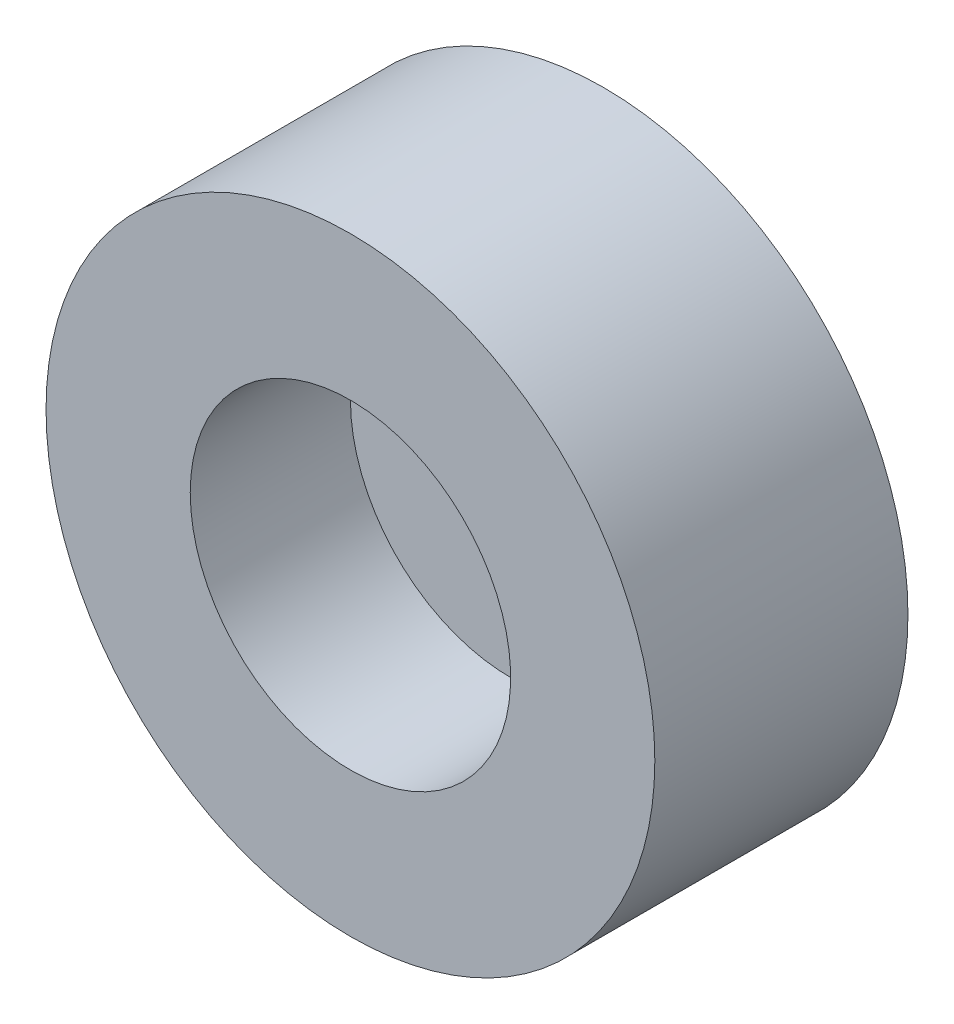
from build123d import *

# Parameters (mm, degrees)
ESQUISSE1_R        = 9.5
ESQUISSE1_R_2      = 5
BOSS_EXTRU_1_DEPTH = 7.9
ESQUISSE2_R        = 5
BOSS_EXTRU_2_DEPTH = 2.9


with BuildPart() as part:
    # Esquisse1 → Boss.-Extru.1 (new body)
    with BuildSketch(Plane.XY):
        with Locations(Location((0, 11, 0), (0, 0, 180))):
            Circle(ESQUISSE1_R)
        with Locations(Location((0, 11, 0), (0, 0, 180))):
            Circle(ESQUISSE1_R_2, mode=Mode.SUBTRACT)
    extrude(amount=BOSS_EXTRU_1_DEPTH)

    # Esquisse2 → Boss.-Extru.2 (add)
    with BuildSketch(Plane(origin=(0, 0, 0), x_dir=(-1, 0, 0), z_dir=(0, 0, -1))):
        with Locations((0, 11)):
            Circle(ESQUISSE2_R)
    extrude(amount=-BOSS_EXTRU_2_DEPTH)


solid = part.part
